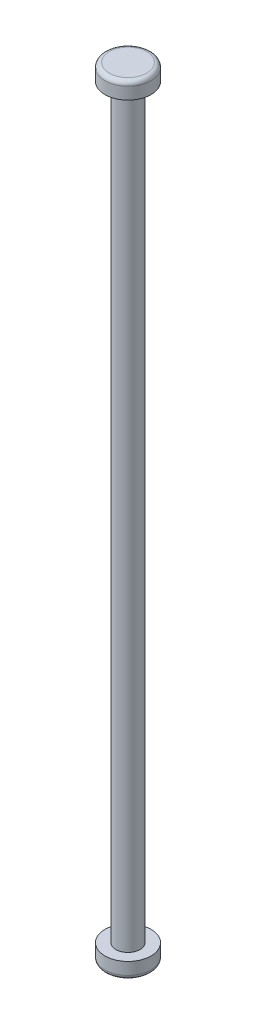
ISO-10303-21;
HEADER;
FILE_DESCRIPTION(('STEP AP214'),'2;1');
FILE_NAME('part.step','',(''),(''),'','','');
FILE_SCHEMA(('AUTOMOTIVE_DESIGN { 1 0 10303 214 1 1 1 1 }'));
ENDSEC;
DATA;
#1=APPLICATION_CONTEXT('core data for automotive mechanical design processes');
#2=APPLICATION_PROTOCOL_DEFINITION('international standard','automotive_design',2000,#1);
#3=PRODUCT_CONTEXT('',#1,'mechanical');
#4=PRODUCT('Part','Part','',(#3));
#5=PRODUCT_RELATED_PRODUCT_CATEGORY('part','',(#4));
#6=PRODUCT_DEFINITION_FORMATION('','',#4);
#7=PRODUCT_DEFINITION_CONTEXT('part definition',#1,'design');
#8=PRODUCT_DEFINITION('design','',#6,#7);
#9=PRODUCT_DEFINITION_SHAPE('','',#8);
#10=(LENGTH_UNIT() NAMED_UNIT(*) SI_UNIT(.MILLI.,.METRE.));
#11=(NAMED_UNIT(*) PLANE_ANGLE_UNIT() SI_UNIT($,.RADIAN.));
#12=(NAMED_UNIT(*) SI_UNIT($,.STERADIAN.) SOLID_ANGLE_UNIT());
#13=UNCERTAINTY_MEASURE_WITH_UNIT(LENGTH_MEASURE(1.E-05),#10,'distance_accuracy_value','');
#14=(GEOMETRIC_REPRESENTATION_CONTEXT(3) GLOBAL_UNCERTAINTY_ASSIGNED_CONTEXT((#13)) GLOBAL_UNIT_ASSIGNED_CONTEXT((#10,
#11,#12)) REPRESENTATION_CONTEXT('',''));
#15=CARTESIAN_POINT('',(0.,0.,0.));
#16=DIRECTION('',(0.,0.,1.));
#17=DIRECTION('',(1.,0.,0.));
#18=AXIS2_PLACEMENT_3D('',#15,#16,#17);
#19=CARTESIAN_POINT('',(0.,11.9,0.));
#20=DIRECTION('',(0.,-1.,0.));
#21=DIRECTION('',(0.,0.,-1.));
#22=AXIS2_PLACEMENT_3D('',#19,#20,#21);
#23=CYLINDRICAL_SURFACE('',#22,0.385);
#24=CARTESIAN_POINT('',(0.,11.9,0.));
#25=DIRECTION('',(0.,1.,0.));
#26=DIRECTION('',(0.,0.,1.));
#27=AXIS2_PLACEMENT_3D('',#24,#25,#26);
#28=CIRCLE('',#27,0.385);
#29=CARTESIAN_POINT('',(0.,11.9,0.385));
#30=VERTEX_POINT('',#29);
#31=EDGE_CURVE('E64',#30,#30,#28,.T.);
#32=ORIENTED_EDGE('',*,*,#31,.F.);
#33=EDGE_LOOP('',(#32));
#34=FACE_BOUND('',#33,.T.);
#35=CARTESIAN_POINT('',(0.,-11.9,0.));
#36=DIRECTION('',(0.,1.,0.));
#37=DIRECTION('',(0.,0.,1.));
#38=AXIS2_PLACEMENT_3D('',#35,#36,#37);
#39=CIRCLE('',#38,0.385);
#40=CARTESIAN_POINT('',(0.,-11.9,0.385));
#41=VERTEX_POINT('',#40);
#42=EDGE_CURVE('E65',#41,#41,#39,.T.);
#43=ORIENTED_EDGE('',*,*,#42,.T.);
#44=EDGE_LOOP('',(#43));
#45=FACE_BOUND('',#44,.T.);
#46=ADVANCED_FACE('F44',(#34,#45),#23,.T.);
#47=CARTESIAN_POINT('',(0.,12.425,0.));
#48=DIRECTION('',(0.,-1.,0.));
#49=DIRECTION('',(0.,0.,-1.));
#50=AXIS2_PLACEMENT_3D('',#47,#48,#49);
#51=CYLINDRICAL_SURFACE('',#50,0.735);
#52=CARTESIAN_POINT('',(0.,12.285,0.));
#53=DIRECTION('',(0.,1.,0.));
#54=DIRECTION('',(0.,0.,1.));
#55=AXIS2_PLACEMENT_3D('',#52,#53,#54);
#56=CIRCLE('',#55,0.735);
#57=CARTESIAN_POINT('',(0.,12.285,0.735));
#58=VERTEX_POINT('',#57);
#59=EDGE_CURVE('E55',#58,#58,#56,.F.);
#60=ORIENTED_EDGE('',*,*,#59,.T.);
#61=EDGE_LOOP('',(#60));
#62=FACE_BOUND('',#61,.T.);
#63=CARTESIAN_POINT('',(0.,11.9,0.));
#64=DIRECTION('',(0.,1.,0.));
#65=DIRECTION('',(0.,0.,1.));
#66=AXIS2_PLACEMENT_3D('',#63,#64,#65);
#67=CIRCLE('',#66,0.735);
#68=CARTESIAN_POINT('',(0.,11.9,0.735));
#69=VERTEX_POINT('',#68);
#70=EDGE_CURVE('E68',#69,#69,#67,.T.);
#71=ORIENTED_EDGE('',*,*,#70,.T.);
#72=EDGE_LOOP('',(#71));
#73=FACE_BOUND('',#72,.T.);
#74=ADVANCED_FACE('F95',(#62,#73),#51,.T.);
#75=CARTESIAN_POINT('',(0.,12.425,0.));
#76=DIRECTION('',(0.,1.,0.));
#77=DIRECTION('',(0.,0.,1.));
#78=AXIS2_PLACEMENT_3D('',#75,#76,#77);
#79=PLANE('',#78);
#80=CARTESIAN_POINT('',(0.,12.425,0.));
#81=DIRECTION('',(0.,1.,0.));
#82=DIRECTION('',(0.,0.,1.));
#83=AXIS2_PLACEMENT_3D('',#80,#81,#82);
#84=CIRCLE('',#83,0.595);
#85=CARTESIAN_POINT('',(0.,12.425,0.595));
#86=VERTEX_POINT('',#85);
#87=EDGE_CURVE('E59',#86,#86,#84,.T.);
#88=ORIENTED_EDGE('',*,*,#87,.T.);
#89=EDGE_LOOP('',(#88));
#90=FACE_BOUND('',#89,.T.);
#91=ADVANCED_FACE('F89',(#90),#79,.T.);
#92=CARTESIAN_POINT('',(0.,11.9,0.));
#93=DIRECTION('',(0.,1.,0.));
#94=DIRECTION('',(0.,0.,1.));
#95=AXIS2_PLACEMENT_3D('',#92,#93,#94);
#96=PLANE('',#95);
#97=ORIENTED_EDGE('',*,*,#31,.T.);
#98=EDGE_LOOP('',(#97));
#99=FACE_BOUND('',#98,.T.);
#100=ORIENTED_EDGE('',*,*,#70,.F.);
#101=EDGE_LOOP('',(#100));
#102=FACE_BOUND('',#101,.T.);
#103=ADVANCED_FACE('F82',(#99,#102),#96,.F.);
#104=CARTESIAN_POINT('',(0.,-12.425,0.));
#105=DIRECTION('',(0.,1.,0.));
#106=DIRECTION('',(0.,0.,1.));
#107=AXIS2_PLACEMENT_3D('',#104,#105,#106);
#108=CYLINDRICAL_SURFACE('',#107,0.735);
#109=CARTESIAN_POINT('',(0.,-12.285,0.));
#110=DIRECTION('',(0.,-1.,0.));
#111=DIRECTION('',(0.,0.,-1.));
#112=AXIS2_PLACEMENT_3D('',#109,#110,#111);
#113=CIRCLE('',#112,0.735);
#114=CARTESIAN_POINT('',(0.,-12.285,-0.735));
#115=VERTEX_POINT('',#114);
#116=EDGE_CURVE('E51',#115,#115,#113,.F.);
#117=ORIENTED_EDGE('',*,*,#116,.T.);
#118=EDGE_LOOP('',(#117));
#119=FACE_BOUND('',#118,.T.);
#120=CARTESIAN_POINT('',(0.,-11.9,0.));
#121=DIRECTION('',(0.,1.,0.));
#122=DIRECTION('',(0.,0.,1.));
#123=AXIS2_PLACEMENT_3D('',#120,#121,#122);
#124=CIRCLE('',#123,0.735);
#125=CARTESIAN_POINT('',(0.,-11.9,0.735));
#126=VERTEX_POINT('',#125);
#127=EDGE_CURVE('E69',#126,#126,#124,.T.);
#128=ORIENTED_EDGE('',*,*,#127,.F.);
#129=EDGE_LOOP('',(#128));
#130=FACE_BOUND('',#129,.T.);
#131=ADVANCED_FACE('F79',(#119,#130),#108,.T.);
#132=CARTESIAN_POINT('',(0.,-12.425,0.));
#133=DIRECTION('',(0.,-1.,0.));
#134=DIRECTION('',(0.,0.,1.));
#135=AXIS2_PLACEMENT_3D('',#132,#133,#134);
#136=PLANE('',#135);
#137=CARTESIAN_POINT('',(0.,-12.425,0.));
#138=DIRECTION('',(0.,-1.,0.));
#139=DIRECTION('',(0.,0.,-1.));
#140=AXIS2_PLACEMENT_3D('',#137,#138,#139);
#141=CIRCLE('',#140,0.595);
#142=CARTESIAN_POINT('',(0.,-12.425,-0.595));
#143=VERTEX_POINT('',#142);
#144=EDGE_CURVE('E10',#143,#143,#141,.T.);
#145=ORIENTED_EDGE('',*,*,#144,.T.);
#146=EDGE_LOOP('',(#145));
#147=FACE_BOUND('',#146,.T.);
#148=ADVANCED_FACE('F81',(#147),#136,.T.);
#149=CARTESIAN_POINT('',(0.,-11.9,0.));
#150=DIRECTION('',(0.,-1.,0.));
#151=DIRECTION('',(0.,0.,1.));
#152=AXIS2_PLACEMENT_3D('',#149,#150,#151);
#153=PLANE('',#152);
#154=ORIENTED_EDGE('',*,*,#42,.F.);
#155=EDGE_LOOP('',(#154));
#156=FACE_BOUND('',#155,.T.);
#157=ORIENTED_EDGE('',*,*,#127,.T.);
#158=EDGE_LOOP('',(#157));
#159=FACE_BOUND('',#158,.T.);
#160=ADVANCED_FACE('F77',(#156,#159),#153,.F.);
#161=CARTESIAN_POINT('',(0.,12.285,0.));
#162=DIRECTION('',(0.,1.,0.));
#163=DIRECTION('',(0.,0.,1.));
#164=AXIS2_PLACEMENT_3D('',#161,#162,#163);
#165=TOROIDAL_SURFACE('',#164,0.595,0.14);
#166=ORIENTED_EDGE('',*,*,#59,.F.);
#167=EDGE_LOOP('',(#166));
#168=FACE_BOUND('',#167,.T.);
#169=ORIENTED_EDGE('',*,*,#87,.F.);
#170=EDGE_LOOP('',(#169));
#171=FACE_BOUND('',#170,.T.);
#172=ADVANCED_FACE('F105',(#168,#171),#165,.T.);
#173=CARTESIAN_POINT('',(0.,-12.285,0.));
#174=DIRECTION('',(0.,-1.,0.));
#175=DIRECTION('',(0.,0.,-1.));
#176=AXIS2_PLACEMENT_3D('',#173,#174,#175);
#177=TOROIDAL_SURFACE('',#176,0.595,0.14);
#178=ORIENTED_EDGE('',*,*,#144,.F.);
#179=EDGE_LOOP('',(#178));
#180=FACE_BOUND('',#179,.T.);
#181=ORIENTED_EDGE('',*,*,#116,.F.);
#182=EDGE_LOOP('',(#181));
#183=FACE_BOUND('',#182,.T.);
#184=ADVANCED_FACE('F46',(#180,#183),#177,.T.);
#185=CLOSED_SHELL('',(#46,#74,#91,#103,#131,#148,#160,#172,#184));
#186=MANIFOLD_SOLID_BREP('B2',#185);
#187=ADVANCED_BREP_SHAPE_REPRESENTATION('',(#18,#186),#14);
#188=SHAPE_DEFINITION_REPRESENTATION(#9,#187);
ENDSEC;
END-ISO-10303-21;
